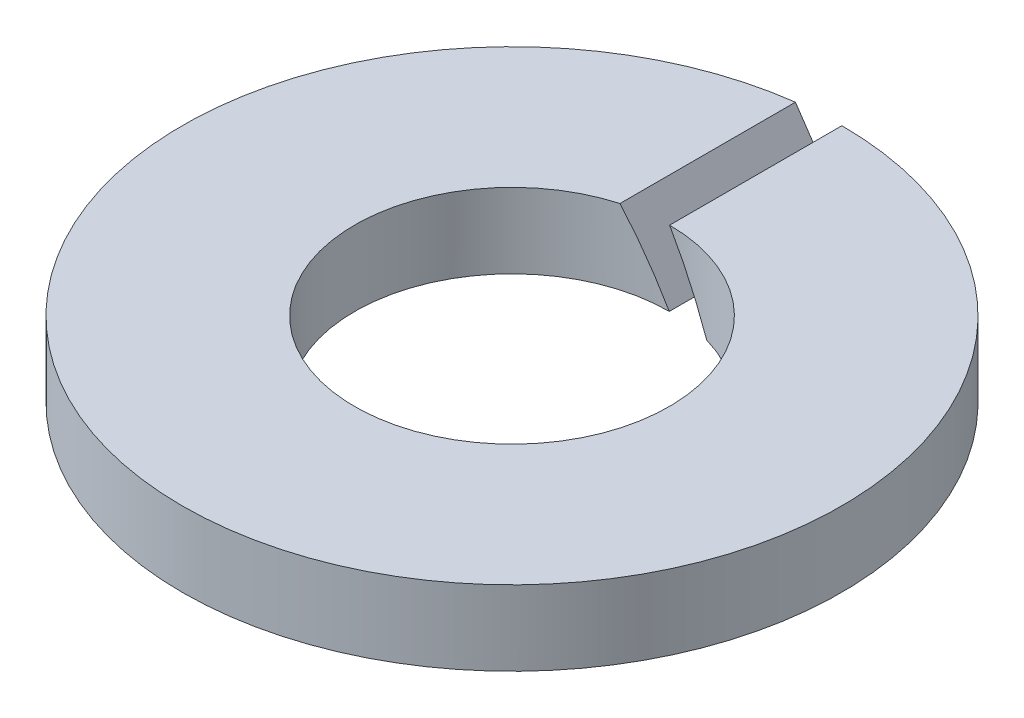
from build123d import *

# Parameters (mm, degrees)
BOSESKE_R      = 2.2
BOSESKE_R_2    = 1.05
BASEBODY_DEPTH = 0.5
SLIT_DEPTH     = 4.151190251


with BuildPart() as part:
    # BoseSke → BaseBody (new body)
    with BuildSketch(Plane(origin=(0, 0, 0), x_dir=(1, 0, 0), z_dir=(0, 1, 0))):
        with Locations(Location((0, 0, 0), (0, 0, 270))):
            Circle(BOSESKE_R)
        with Locations(Location((0, 0, 0), (0, 0, 270))):
            Circle(BOSESKE_R_2, mode=Mode.SUBTRACT)
    extrude(amount=BASEBODY_DEPTH)

    # SlitSke → Slit (cut, through all)
    with BuildSketch(Plane.XY):
        Polygon((0, 0), (-0.288675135, 0.5), (0.002309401, 0.5), (0.290984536, 0), align=None)
    extrude(amount=-SLIT_DEPTH, mode=Mode.SUBTRACT)


solid = part.part
